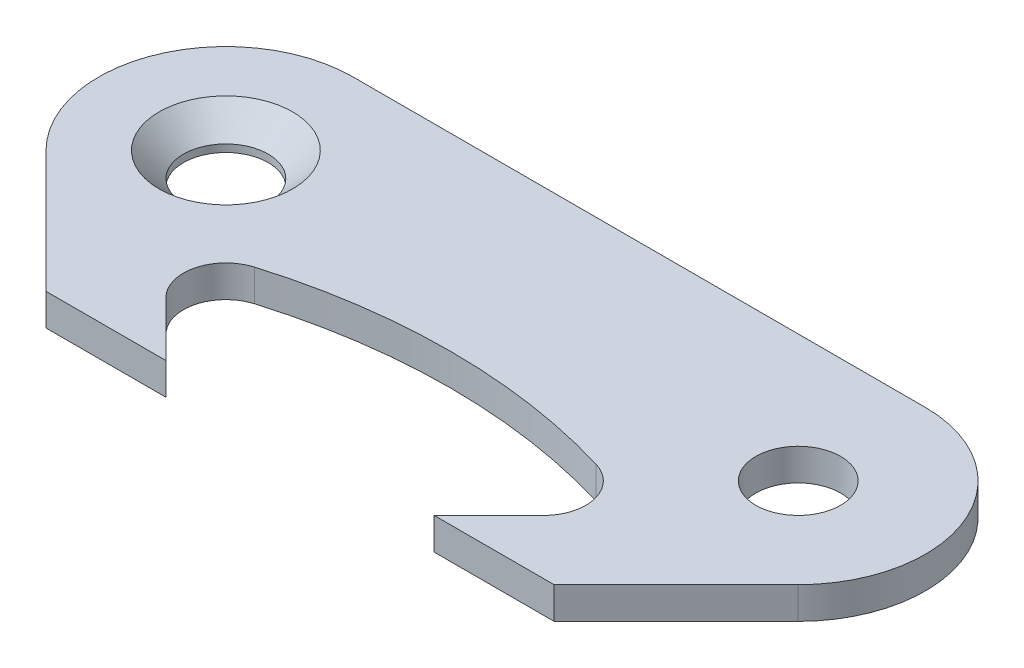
ISO-10303-21;
HEADER;
FILE_DESCRIPTION(('STEP AP214'),'2;1');
FILE_NAME('part.step','',(''),(''),'','','');
FILE_SCHEMA(('AUTOMOTIVE_DESIGN { 1 0 10303 214 1 1 1 1 }'));
ENDSEC;
DATA;
#1=APPLICATION_CONTEXT('core data for automotive mechanical design processes');
#2=APPLICATION_PROTOCOL_DEFINITION('international standard','automotive_design',2000,#1);
#3=PRODUCT_CONTEXT('',#1,'mechanical');
#4=PRODUCT('Part','Part','',(#3));
#5=PRODUCT_RELATED_PRODUCT_CATEGORY('part','',(#4));
#6=PRODUCT_DEFINITION_FORMATION('','',#4);
#7=PRODUCT_DEFINITION_CONTEXT('part definition',#1,'design');
#8=PRODUCT_DEFINITION('design','',#6,#7);
#9=PRODUCT_DEFINITION_SHAPE('','',#8);
#10=(LENGTH_UNIT() NAMED_UNIT(*) SI_UNIT(.MILLI.,.METRE.));
#11=(NAMED_UNIT(*) PLANE_ANGLE_UNIT() SI_UNIT($,.RADIAN.));
#12=(NAMED_UNIT(*) SI_UNIT($,.STERADIAN.) SOLID_ANGLE_UNIT());
#13=UNCERTAINTY_MEASURE_WITH_UNIT(LENGTH_MEASURE(1.E-05),#10,'distance_accuracy_value','');
#14=(GEOMETRIC_REPRESENTATION_CONTEXT(3) GLOBAL_UNCERTAINTY_ASSIGNED_CONTEXT((#13)) GLOBAL_UNIT_ASSIGNED_CONTEXT((#10,
#11,#12)) REPRESENTATION_CONTEXT('',''));
#15=CARTESIAN_POINT('',(0.,0.,0.));
#16=DIRECTION('',(0.,0.,1.));
#17=DIRECTION('',(1.,0.,0.));
#18=AXIS2_PLACEMENT_3D('',#15,#16,#17);
#19=CARTESIAN_POINT('',(0.,3.,0.));
#20=DIRECTION('',(0.,-1.,0.));
#21=DIRECTION('',(0.,0.,-1.));
#22=AXIS2_PLACEMENT_3D('',#19,#20,#21);
#23=CYLINDRICAL_SURFACE('',#22,4.);
#24=CARTESIAN_POINT('',(0.,0.,0.));
#25=DIRECTION('',(0.,1.,0.));
#26=DIRECTION('',(0.,0.,1.));
#27=AXIS2_PLACEMENT_3D('',#24,#25,#26);
#28=CIRCLE('',#27,4.);
#29=CARTESIAN_POINT('',(0.,0.,4.));
#30=VERTEX_POINT('',#29);
#31=EDGE_CURVE('E157',#30,#30,#28,.T.);
#32=ORIENTED_EDGE('',*,*,#31,.F.);
#33=EDGE_LOOP('',(#32));
#34=FACE_BOUND('',#33,.T.);
#35=CARTESIAN_POINT('',(0.,0.7,0.));
#36=DIRECTION('',(0.,1.,0.));
#37=DIRECTION('',(0.,0.,1.));
#38=AXIS2_PLACEMENT_3D('',#35,#36,#37);
#39=CIRCLE('',#38,4.);
#40=CARTESIAN_POINT('',(0.,0.7,4.));
#41=VERTEX_POINT('',#40);
#42=EDGE_CURVE('E284',#41,#41,#39,.T.);
#43=ORIENTED_EDGE('',*,*,#42,.T.);
#44=EDGE_LOOP('',(#43));
#45=FACE_BOUND('',#44,.T.);
#46=ADVANCED_FACE('F31',(#34,#45),#23,.F.);
#47=CARTESIAN_POINT('',(12.0208152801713,3.,12.0208152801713));
#48=DIRECTION('',(0.,1.,0.));
#49=DIRECTION('',(0.,0.,1.));
#50=AXIS2_PLACEMENT_3D('',#47,#48,#49);
#51=PLANE('',#50);
#52=CARTESIAN_POINT('',(0.,3.,0.));
#53=DIRECTION('',(0.,1.,0.));
#54=DIRECTION('',(0.,0.,1.));
#55=AXIS2_PLACEMENT_3D('',#52,#53,#54);
#56=CIRCLE('',#55,6.3);
#57=CARTESIAN_POINT('',(0.,3.,6.3));
#58=VERTEX_POINT('',#57);
#59=EDGE_CURVE('E288',#58,#58,#56,.T.);
#60=ORIENTED_EDGE('',*,*,#59,.F.);
#61=EDGE_LOOP('',(#60));
#62=FACE_BOUND('',#61,.T.);
#63=CARTESIAN_POINT('',(12.0208152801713,3.,12.0208152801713));
#64=DIRECTION('',(0.,-1.,0.));
#65=DIRECTION('',(0.,0.,1.));
#66=AXIS2_PLACEMENT_3D('',#63,#64,#65);
#67=CIRCLE('',#66,4.);
#68=CARTESIAN_POINT('',(9.19238815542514,3.,14.8492424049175));
#69=VERTEX_POINT('',#68);
#70=CARTESIAN_POINT('',(10.868570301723,3.,8.19036732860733));
#71=VERTEX_POINT('',#70);
#72=EDGE_CURVE('E176',#69,#71,#67,.T.);
#73=ORIENTED_EDGE('',*,*,#72,.T.);
#74=CARTESIAN_POINT('',(27.,3.,61.8166386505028));
#75=DIRECTION('',(0.,-1.,0.));
#76=DIRECTION('',(0.,0.,1.));
#77=AXIS2_PLACEMENT_3D('',#74,#75,#76);
#78=CIRCLE('',#77,56.);
#79=CARTESIAN_POINT('',(43.131429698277,3.,8.19036732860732));
#80=VERTEX_POINT('',#79);
#81=EDGE_CURVE('E103',#71,#80,#78,.T.);
#82=ORIENTED_EDGE('',*,*,#81,.T.);
#83=CARTESIAN_POINT('',(41.9791847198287,3.,12.0208152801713));
#84=DIRECTION('',(0.,-1.,0.));
#85=DIRECTION('',(0.,0.,1.));
#86=AXIS2_PLACEMENT_3D('',#83,#84,#85);
#87=CIRCLE('',#86,3.99999999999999);
#88=CARTESIAN_POINT('',(44.8076118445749,3.,14.8492424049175));
#89=VERTEX_POINT('',#88);
#90=EDGE_CURVE('E203',#80,#89,#87,.T.);
#91=ORIENTED_EDGE('',*,*,#90,.T.);
#92=DIRECTION('',(-0.707106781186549,0.,0.707106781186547));
#93=VECTOR('',#92,1.);
#94=CARTESIAN_POINT('',(44.8076118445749,3.,14.8492424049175));
#95=LINE('',#94,#93);
#96=CARTESIAN_POINT('',(39.6568542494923,3.,20.));
#97=VERTEX_POINT('',#96);
#98=EDGE_CURVE('E222',#89,#97,#95,.T.);
#99=ORIENTED_EDGE('',*,*,#98,.T.);
#100=DIRECTION('',(1.,0.,0.));
#101=VECTOR('',#100,1.);
#102=CARTESIAN_POINT('',(39.6568542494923,3.,20.));
#103=LINE('',#102,#101);
#104=CARTESIAN_POINT('',(50.9705627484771,3.,20.));
#105=VERTEX_POINT('',#104);
#106=EDGE_CURVE('E219',#97,#105,#103,.T.);
#107=ORIENTED_EDGE('',*,*,#106,.T.);
#108=DIRECTION('',(0.707106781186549,0.,-0.707106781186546));
#109=VECTOR('',#108,1.);
#110=CARTESIAN_POINT('',(62.4852813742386,3.,8.48528137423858));
#111=LINE('',#110,#109);
#112=CARTESIAN_POINT('',(62.4852813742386,3.,8.48528137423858));
#113=VERTEX_POINT('',#112);
#114=EDGE_CURVE('E221',#105,#113,#111,.T.);
#115=ORIENTED_EDGE('',*,*,#114,.T.);
#116=CARTESIAN_POINT('',(54.,3.,0.));
#117=DIRECTION('',(0.,1.,0.));
#118=DIRECTION('',(0.,0.,1.));
#119=AXIS2_PLACEMENT_3D('',#116,#117,#118);
#120=CIRCLE('',#119,12.);
#121=CARTESIAN_POINT('',(54.,3.,-12.));
#122=VERTEX_POINT('',#121);
#123=EDGE_CURVE('E224',#113,#122,#120,.T.);
#124=ORIENTED_EDGE('',*,*,#123,.T.);
#125=DIRECTION('',(-1.,0.,0.));
#126=VECTOR('',#125,1.);
#127=CARTESIAN_POINT('',(0.,3.,-12.));
#128=LINE('',#127,#126);
#129=CARTESIAN_POINT('',(0.,3.,-12.));
#130=VERTEX_POINT('',#129);
#131=EDGE_CURVE('E230',#122,#130,#128,.T.);
#132=ORIENTED_EDGE('',*,*,#131,.T.);
#133=CARTESIAN_POINT('',(0.,3.,0.));
#134=DIRECTION('',(0.,1.,0.));
#135=DIRECTION('',(0.,0.,1.));
#136=AXIS2_PLACEMENT_3D('',#133,#134,#135);
#137=CIRCLE('',#136,12.);
#138=CARTESIAN_POINT('',(-8.48528137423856,3.,8.48528137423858));
#139=VERTEX_POINT('',#138);
#140=EDGE_CURVE('E135',#130,#139,#137,.T.);
#141=ORIENTED_EDGE('',*,*,#140,.T.);
#142=DIRECTION('',(0.707106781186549,0.,0.707106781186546));
#143=VECTOR('',#142,1.);
#144=CARTESIAN_POINT('',(-8.48528137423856,3.,8.48528137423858));
#145=LINE('',#144,#143);
#146=CARTESIAN_POINT('',(3.0294372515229,3.,20.));
#147=VERTEX_POINT('',#146);
#148=EDGE_CURVE('E128',#139,#147,#145,.T.);
#149=ORIENTED_EDGE('',*,*,#148,.T.);
#150=DIRECTION('',(1.,0.,0.));
#151=VECTOR('',#150,1.);
#152=CARTESIAN_POINT('',(3.0294372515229,3.,20.));
#153=LINE('',#152,#151);
#154=CARTESIAN_POINT('',(14.3431457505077,3.,20.));
#155=VERTEX_POINT('',#154);
#156=EDGE_CURVE('E133',#147,#155,#153,.T.);
#157=ORIENTED_EDGE('',*,*,#156,.T.);
#158=DIRECTION('',(-0.707106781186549,0.,-0.707106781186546));
#159=VECTOR('',#158,1.);
#160=CARTESIAN_POINT('',(9.19238815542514,3.,14.8492424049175));
#161=LINE('',#160,#159);
#162=EDGE_CURVE('E48',#155,#69,#161,.T.);
#163=ORIENTED_EDGE('',*,*,#162,.T.);
#164=EDGE_LOOP('',(#73,#82,#91,#99,#107,#115,#124,#132,#141,#149,#157,#163));
#165=FACE_BOUND('',#164,.T.);
#166=CARTESIAN_POINT('',(54.,3.,0.));
#167=DIRECTION('',(0.,1.,0.));
#168=DIRECTION('',(0.,0.,1.));
#169=AXIS2_PLACEMENT_3D('',#166,#167,#168);
#170=CIRCLE('',#169,4.);
#171=CARTESIAN_POINT('',(54.,3.,4.));
#172=VERTEX_POINT('',#171);
#173=EDGE_CURVE('E275',#172,#172,#170,.T.);
#174=ORIENTED_EDGE('',*,*,#173,.F.);
#175=EDGE_LOOP('',(#174));
#176=FACE_BOUND('',#175,.T.);
#177=ADVANCED_FACE('F130',(#62,#165,#176),#51,.T.);
#178=CARTESIAN_POINT('',(12.0208152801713,0.,12.0208152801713));
#179=DIRECTION('',(0.,1.,0.));
#180=DIRECTION('',(0.,0.,1.));
#181=AXIS2_PLACEMENT_3D('',#178,#179,#180);
#182=PLANE('',#181);
#183=ORIENTED_EDGE('',*,*,#31,.T.);
#184=EDGE_LOOP('',(#183));
#185=FACE_BOUND('',#184,.T.);
#186=CARTESIAN_POINT('',(12.0208152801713,0.,12.0208152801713));
#187=DIRECTION('',(0.,-1.,0.));
#188=DIRECTION('',(0.,0.,1.));
#189=AXIS2_PLACEMENT_3D('',#186,#187,#188);
#190=CIRCLE('',#189,4.);
#191=CARTESIAN_POINT('',(9.19238815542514,0.,14.8492424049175));
#192=VERTEX_POINT('',#191);
#193=CARTESIAN_POINT('',(10.868570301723,0.,8.19036732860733));
#194=VERTEX_POINT('',#193);
#195=EDGE_CURVE('E153',#192,#194,#190,.T.);
#196=ORIENTED_EDGE('',*,*,#195,.F.);
#197=DIRECTION('',(-0.707106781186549,0.,-0.707106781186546));
#198=VECTOR('',#197,1.);
#199=CARTESIAN_POINT('',(9.19238815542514,0.,14.8492424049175));
#200=LINE('',#199,#198);
#201=CARTESIAN_POINT('',(14.3431457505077,0.,20.));
#202=VERTEX_POINT('',#201);
#203=EDGE_CURVE('E95',#202,#192,#200,.T.);
#204=ORIENTED_EDGE('',*,*,#203,.F.);
#205=DIRECTION('',(1.,0.,0.));
#206=VECTOR('',#205,1.);
#207=CARTESIAN_POINT('',(3.0294372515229,0.,20.));
#208=LINE('',#207,#206);
#209=CARTESIAN_POINT('',(3.0294372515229,0.,20.));
#210=VERTEX_POINT('',#209);
#211=EDGE_CURVE('E89',#210,#202,#208,.T.);
#212=ORIENTED_EDGE('',*,*,#211,.F.);
#213=DIRECTION('',(0.707106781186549,0.,0.707106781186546));
#214=VECTOR('',#213,1.);
#215=CARTESIAN_POINT('',(-8.48528137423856,0.,8.48528137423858));
#216=LINE('',#215,#214);
#217=CARTESIAN_POINT('',(-8.48528137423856,0.,8.48528137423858));
#218=VERTEX_POINT('',#217);
#219=EDGE_CURVE('E143',#218,#210,#216,.T.);
#220=ORIENTED_EDGE('',*,*,#219,.F.);
#221=CARTESIAN_POINT('',(0.,0.,0.));
#222=DIRECTION('',(0.,1.,0.));
#223=DIRECTION('',(0.,0.,1.));
#224=AXIS2_PLACEMENT_3D('',#221,#222,#223);
#225=CIRCLE('',#224,12.);
#226=CARTESIAN_POINT('',(0.,0.,-12.));
#227=VERTEX_POINT('',#226);
#228=EDGE_CURVE('E171',#227,#218,#225,.T.);
#229=ORIENTED_EDGE('',*,*,#228,.F.);
#230=DIRECTION('',(-1.,0.,0.));
#231=VECTOR('',#230,1.);
#232=CARTESIAN_POINT('',(0.,0.,-12.));
#233=LINE('',#232,#231);
#234=CARTESIAN_POINT('',(54.,0.,-12.));
#235=VERTEX_POINT('',#234);
#236=EDGE_CURVE('E169',#235,#227,#233,.T.);
#237=ORIENTED_EDGE('',*,*,#236,.F.);
#238=CARTESIAN_POINT('',(54.,0.,0.));
#239=DIRECTION('',(0.,1.,0.));
#240=DIRECTION('',(0.,0.,1.));
#241=AXIS2_PLACEMENT_3D('',#238,#239,#240);
#242=CIRCLE('',#241,12.);
#243=CARTESIAN_POINT('',(62.4852813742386,0.,8.48528137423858));
#244=VERTEX_POINT('',#243);
#245=EDGE_CURVE('E167',#244,#235,#242,.T.);
#246=ORIENTED_EDGE('',*,*,#245,.F.);
#247=DIRECTION('',(0.707106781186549,0.,-0.707106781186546));
#248=VECTOR('',#247,1.);
#249=CARTESIAN_POINT('',(62.4852813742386,0.,8.48528137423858));
#250=LINE('',#249,#248);
#251=CARTESIAN_POINT('',(50.9705627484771,0.,20.));
#252=VERTEX_POINT('',#251);
#253=EDGE_CURVE('E165',#252,#244,#250,.T.);
#254=ORIENTED_EDGE('',*,*,#253,.F.);
#255=DIRECTION('',(1.,0.,0.));
#256=VECTOR('',#255,1.);
#257=CARTESIAN_POINT('',(39.6568542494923,0.,20.));
#258=LINE('',#257,#256);
#259=CARTESIAN_POINT('',(39.6568542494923,0.,20.));
#260=VERTEX_POINT('',#259);
#261=EDGE_CURVE('E163',#260,#252,#258,.T.);
#262=ORIENTED_EDGE('',*,*,#261,.F.);
#263=DIRECTION('',(-0.707106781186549,0.,0.707106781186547));
#264=VECTOR('',#263,1.);
#265=CARTESIAN_POINT('',(44.8076118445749,0.,14.8492424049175));
#266=LINE('',#265,#264);
#267=CARTESIAN_POINT('',(44.8076118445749,0.,14.8492424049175));
#268=VERTEX_POINT('',#267);
#269=EDGE_CURVE('E161',#268,#260,#266,.T.);
#270=ORIENTED_EDGE('',*,*,#269,.F.);
#271=CARTESIAN_POINT('',(41.9791847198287,0.,12.0208152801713));
#272=DIRECTION('',(0.,-1.,0.));
#273=DIRECTION('',(0.,0.,1.));
#274=AXIS2_PLACEMENT_3D('',#271,#272,#273);
#275=CIRCLE('',#274,3.99999999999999);
#276=CARTESIAN_POINT('',(43.131429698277,0.,8.19036732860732));
#277=VERTEX_POINT('',#276);
#278=EDGE_CURVE('E159',#277,#268,#275,.T.);
#279=ORIENTED_EDGE('',*,*,#278,.F.);
#280=CARTESIAN_POINT('',(27.,0.,61.8166386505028));
#281=DIRECTION('',(0.,-1.,0.));
#282=DIRECTION('',(0.,0.,1.));
#283=AXIS2_PLACEMENT_3D('',#280,#281,#282);
#284=CIRCLE('',#283,56.);
#285=EDGE_CURVE('E156',#194,#277,#284,.T.);
#286=ORIENTED_EDGE('',*,*,#285,.F.);
#287=EDGE_LOOP('',(#196,#204,#212,#220,#229,#237,#246,#254,#262,#270,#279,#286));
#288=FACE_BOUND('',#287,.T.);
#289=CARTESIAN_POINT('',(54.,0.,0.));
#290=DIRECTION('',(0.,1.,0.));
#291=DIRECTION('',(0.,0.,1.));
#292=AXIS2_PLACEMENT_3D('',#289,#290,#291);
#293=CIRCLE('',#292,4.);
#294=CARTESIAN_POINT('',(54.,0.,4.));
#295=VERTEX_POINT('',#294);
#296=EDGE_CURVE('E278',#295,#295,#293,.T.);
#297=ORIENTED_EDGE('',*,*,#296,.T.);
#298=EDGE_LOOP('',(#297));
#299=FACE_BOUND('',#298,.T.);
#300=ADVANCED_FACE('F207',(#185,#288,#299),#182,.F.);
#301=CARTESIAN_POINT('',(12.0208152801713,3.,12.0208152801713));
#302=DIRECTION('',(0.,-1.,0.));
#303=DIRECTION('',(0.,0.,-1.));
#304=AXIS2_PLACEMENT_3D('',#301,#302,#303);
#305=CYLINDRICAL_SURFACE('',#304,4.);
#306=ORIENTED_EDGE('',*,*,#195,.T.);
#307=DIRECTION('',(0.,-1.,0.));
#308=VECTOR('',#307,1.);
#309=CARTESIAN_POINT('',(10.868570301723,3.,8.19036732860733));
#310=LINE('',#309,#308);
#311=EDGE_CURVE('E11',#71,#194,#310,.T.);
#312=ORIENTED_EDGE('',*,*,#311,.F.);
#313=ORIENTED_EDGE('',*,*,#72,.F.);
#314=DIRECTION('',(0.,-1.,0.));
#315=VECTOR('',#314,1.);
#316=CARTESIAN_POINT('',(9.19238815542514,3.,14.8492424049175));
#317=LINE('',#316,#315);
#318=EDGE_CURVE('E149',#69,#192,#317,.T.);
#319=ORIENTED_EDGE('',*,*,#318,.T.);
#320=EDGE_LOOP('',(#306,#312,#313,#319));
#321=FACE_BOUND('',#320,.T.);
#322=ADVANCED_FACE('F33',(#321),#305,.F.);
#323=CARTESIAN_POINT('',(27.,3.,61.8166386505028));
#324=DIRECTION('',(0.,-1.,0.));
#325=DIRECTION('',(0.,0.,-1.));
#326=AXIS2_PLACEMENT_3D('',#323,#324,#325);
#327=CYLINDRICAL_SURFACE('',#326,56.);
#328=ORIENTED_EDGE('',*,*,#285,.T.);
#329=DIRECTION('',(0.,-1.,0.));
#330=VECTOR('',#329,1.);
#331=CARTESIAN_POINT('',(43.131429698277,3.,8.19036732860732));
#332=LINE('',#331,#330);
#333=EDGE_CURVE('E40',#80,#277,#332,.T.);
#334=ORIENTED_EDGE('',*,*,#333,.F.);
#335=ORIENTED_EDGE('',*,*,#81,.F.);
#336=ORIENTED_EDGE('',*,*,#311,.T.);
#337=EDGE_LOOP('',(#328,#334,#335,#336));
#338=FACE_BOUND('',#337,.T.);
#339=ADVANCED_FACE('F273',(#338),#327,.F.);
#340=CARTESIAN_POINT('',(41.9791847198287,3.,12.0208152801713));
#341=DIRECTION('',(0.,-1.,0.));
#342=DIRECTION('',(0.,0.,-1.));
#343=AXIS2_PLACEMENT_3D('',#340,#341,#342);
#344=CYLINDRICAL_SURFACE('',#343,3.99999999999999);
#345=ORIENTED_EDGE('',*,*,#278,.T.);
#346=DIRECTION('',(0.,-1.,0.));
#347=VECTOR('',#346,1.);
#348=CARTESIAN_POINT('',(44.8076118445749,3.,14.8492424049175));
#349=LINE('',#348,#347);
#350=EDGE_CURVE('E195',#89,#268,#349,.T.);
#351=ORIENTED_EDGE('',*,*,#350,.F.);
#352=ORIENTED_EDGE('',*,*,#90,.F.);
#353=ORIENTED_EDGE('',*,*,#333,.T.);
#354=EDGE_LOOP('',(#345,#351,#352,#353));
#355=FACE_BOUND('',#354,.T.);
#356=ADVANCED_FACE('F201',(#355),#344,.F.);
#357=CARTESIAN_POINT('',(44.8076118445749,3.,14.8492424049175));
#358=DIRECTION('',(0.707106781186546,0.,0.707106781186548));
#359=DIRECTION('',(0.707106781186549,0.,-0.707106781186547));
#360=AXIS2_PLACEMENT_3D('',#357,#358,#359);
#361=PLANE('',#360);
#362=ORIENTED_EDGE('',*,*,#269,.T.);
#363=DIRECTION('',(0.,-1.,0.));
#364=VECTOR('',#363,1.);
#365=CARTESIAN_POINT('',(39.6568542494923,3.,20.));
#366=LINE('',#365,#364);
#367=EDGE_CURVE('E192',#97,#260,#366,.T.);
#368=ORIENTED_EDGE('',*,*,#367,.F.);
#369=ORIENTED_EDGE('',*,*,#98,.F.);
#370=ORIENTED_EDGE('',*,*,#350,.T.);
#371=EDGE_LOOP('',(#362,#368,#369,#370));
#372=FACE_BOUND('',#371,.T.);
#373=ADVANCED_FACE('F213',(#372),#361,.F.);
#374=CARTESIAN_POINT('',(39.6568542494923,3.,20.));
#375=DIRECTION('',(0.,0.,-1.));
#376=DIRECTION('',(-1.,0.,0.));
#377=AXIS2_PLACEMENT_3D('',#374,#375,#376);
#378=PLANE('',#377);
#379=ORIENTED_EDGE('',*,*,#261,.T.);
#380=DIRECTION('',(0.,-1.,0.));
#381=VECTOR('',#380,1.);
#382=CARTESIAN_POINT('',(50.9705627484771,3.,20.));
#383=LINE('',#382,#381);
#384=EDGE_CURVE('E189',#105,#252,#383,.T.);
#385=ORIENTED_EDGE('',*,*,#384,.F.);
#386=ORIENTED_EDGE('',*,*,#106,.F.);
#387=ORIENTED_EDGE('',*,*,#367,.T.);
#388=EDGE_LOOP('',(#379,#385,#386,#387));
#389=FACE_BOUND('',#388,.T.);
#390=ADVANCED_FACE('F217',(#389),#378,.F.);
#391=CARTESIAN_POINT('',(62.4852813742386,3.,8.48528137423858));
#392=DIRECTION('',(-0.707106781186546,0.,-0.707106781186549));
#393=DIRECTION('',(-0.707106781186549,0.,0.707106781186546));
#394=AXIS2_PLACEMENT_3D('',#391,#392,#393);
#395=PLANE('',#394);
#396=ORIENTED_EDGE('',*,*,#253,.T.);
#397=DIRECTION('',(0.,-1.,0.));
#398=VECTOR('',#397,1.);
#399=CARTESIAN_POINT('',(62.4852813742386,3.,8.48528137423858));
#400=LINE('',#399,#398);
#401=EDGE_CURVE('E186',#113,#244,#400,.T.);
#402=ORIENTED_EDGE('',*,*,#401,.F.);
#403=ORIENTED_EDGE('',*,*,#114,.F.);
#404=ORIENTED_EDGE('',*,*,#384,.T.);
#405=EDGE_LOOP('',(#396,#402,#403,#404));
#406=FACE_BOUND('',#405,.T.);
#407=ADVANCED_FACE('F353',(#406),#395,.F.);
#408=CARTESIAN_POINT('',(54.,3.,0.));
#409=DIRECTION('',(0.,-1.,0.));
#410=DIRECTION('',(0.,0.,-1.));
#411=AXIS2_PLACEMENT_3D('',#408,#409,#410);
#412=CYLINDRICAL_SURFACE('',#411,12.);
#413=ORIENTED_EDGE('',*,*,#245,.T.);
#414=DIRECTION('',(0.,-1.,0.));
#415=VECTOR('',#414,1.);
#416=CARTESIAN_POINT('',(54.,3.,-12.));
#417=LINE('',#416,#415);
#418=EDGE_CURVE('E183',#122,#235,#417,.T.);
#419=ORIENTED_EDGE('',*,*,#418,.F.);
#420=ORIENTED_EDGE('',*,*,#123,.F.);
#421=ORIENTED_EDGE('',*,*,#401,.T.);
#422=EDGE_LOOP('',(#413,#419,#420,#421));
#423=FACE_BOUND('',#422,.T.);
#424=ADVANCED_FACE('F361',(#423),#412,.T.);
#425=CARTESIAN_POINT('',(0.,3.,-12.));
#426=DIRECTION('',(0.,0.,1.));
#427=DIRECTION('',(1.,0.,0.));
#428=AXIS2_PLACEMENT_3D('',#425,#426,#427);
#429=PLANE('',#428);
#430=ORIENTED_EDGE('',*,*,#236,.T.);
#431=DIRECTION('',(0.,-1.,0.));
#432=VECTOR('',#431,1.);
#433=CARTESIAN_POINT('',(0.,3.,-12.));
#434=LINE('',#433,#432);
#435=EDGE_CURVE('E180',#130,#227,#434,.T.);
#436=ORIENTED_EDGE('',*,*,#435,.F.);
#437=ORIENTED_EDGE('',*,*,#131,.F.);
#438=ORIENTED_EDGE('',*,*,#418,.T.);
#439=EDGE_LOOP('',(#430,#436,#437,#438));
#440=FACE_BOUND('',#439,.T.);
#441=ADVANCED_FACE('F236',(#440),#429,.F.);
#442=CARTESIAN_POINT('',(0.,3.,0.));
#443=DIRECTION('',(0.,-1.,0.));
#444=DIRECTION('',(0.,0.,-1.));
#445=AXIS2_PLACEMENT_3D('',#442,#443,#444);
#446=CYLINDRICAL_SURFACE('',#445,12.);
#447=ORIENTED_EDGE('',*,*,#228,.T.);
#448=DIRECTION('',(0.,-1.,0.));
#449=VECTOR('',#448,1.);
#450=CARTESIAN_POINT('',(-8.48528137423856,3.,8.48528137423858));
#451=LINE('',#450,#449);
#452=EDGE_CURVE('E144',#139,#218,#451,.T.);
#453=ORIENTED_EDGE('',*,*,#452,.F.);
#454=ORIENTED_EDGE('',*,*,#140,.F.);
#455=ORIENTED_EDGE('',*,*,#435,.T.);
#456=EDGE_LOOP('',(#447,#453,#454,#455));
#457=FACE_BOUND('',#456,.T.);
#458=ADVANCED_FACE('F240',(#457),#446,.T.);
#459=CARTESIAN_POINT('',(-8.48528137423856,3.,8.48528137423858));
#460=DIRECTION('',(0.707106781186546,0.,-0.707106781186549));
#461=DIRECTION('',(-0.707106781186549,0.,-0.707106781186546));
#462=AXIS2_PLACEMENT_3D('',#459,#460,#461);
#463=PLANE('',#462);
#464=ORIENTED_EDGE('',*,*,#219,.T.);
#465=DIRECTION('',(0.,-1.,0.));
#466=VECTOR('',#465,1.);
#467=CARTESIAN_POINT('',(3.0294372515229,3.,20.));
#468=LINE('',#467,#466);
#469=EDGE_CURVE('E140',#147,#210,#468,.T.);
#470=ORIENTED_EDGE('',*,*,#469,.F.);
#471=ORIENTED_EDGE('',*,*,#148,.F.);
#472=ORIENTED_EDGE('',*,*,#452,.T.);
#473=EDGE_LOOP('',(#464,#470,#471,#472));
#474=FACE_BOUND('',#473,.T.);
#475=ADVANCED_FACE('F141',(#474),#463,.F.);
#476=CARTESIAN_POINT('',(3.0294372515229,3.,20.));
#477=DIRECTION('',(0.,0.,-1.));
#478=DIRECTION('',(-1.,0.,0.));
#479=AXIS2_PLACEMENT_3D('',#476,#477,#478);
#480=PLANE('',#479);
#481=ORIENTED_EDGE('',*,*,#211,.T.);
#482=DIRECTION('',(0.,-1.,0.));
#483=VECTOR('',#482,1.);
#484=CARTESIAN_POINT('',(14.3431457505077,3.,20.));
#485=LINE('',#484,#483);
#486=EDGE_CURVE('E145',#155,#202,#485,.T.);
#487=ORIENTED_EDGE('',*,*,#486,.F.);
#488=ORIENTED_EDGE('',*,*,#156,.F.);
#489=ORIENTED_EDGE('',*,*,#469,.T.);
#490=EDGE_LOOP('',(#481,#487,#488,#489));
#491=FACE_BOUND('',#490,.T.);
#492=ADVANCED_FACE('F147',(#491),#480,.F.);
#493=CARTESIAN_POINT('',(9.19238815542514,3.,14.8492424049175));
#494=DIRECTION('',(-0.707106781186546,0.,0.707106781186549));
#495=DIRECTION('',(0.707106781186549,0.,0.707106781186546));
#496=AXIS2_PLACEMENT_3D('',#493,#494,#495);
#497=PLANE('',#496);
#498=ORIENTED_EDGE('',*,*,#203,.T.);
#499=ORIENTED_EDGE('',*,*,#318,.F.);
#500=ORIENTED_EDGE('',*,*,#162,.F.);
#501=ORIENTED_EDGE('',*,*,#486,.T.);
#502=EDGE_LOOP('',(#498,#499,#500,#501));
#503=FACE_BOUND('',#502,.T.);
#504=ADVANCED_FACE('F244',(#503),#497,.F.);
#505=CARTESIAN_POINT('',(54.,3.,0.));
#506=DIRECTION('',(0.,-1.,0.));
#507=DIRECTION('',(0.,0.,-1.));
#508=AXIS2_PLACEMENT_3D('',#505,#506,#507);
#509=CYLINDRICAL_SURFACE('',#508,4.);
#510=ORIENTED_EDGE('',*,*,#173,.T.);
#511=EDGE_LOOP('',(#510));
#512=FACE_BOUND('',#511,.T.);
#513=ORIENTED_EDGE('',*,*,#296,.F.);
#514=EDGE_LOOP('',(#513));
#515=FACE_BOUND('',#514,.T.);
#516=ADVANCED_FACE('F246',(#512,#515),#509,.F.);
#517=CARTESIAN_POINT('',(0.,3.,0.));
#518=DIRECTION('',(0.,1.,0.));
#519=DIRECTION('',(0.,0.,1.));
#520=AXIS2_PLACEMENT_3D('',#517,#518,#519);
#521=CONICAL_SURFACE('',#520,6.3,0.785398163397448);
#522=ORIENTED_EDGE('',*,*,#42,.F.);
#523=EDGE_LOOP('',(#522));
#524=FACE_BOUND('',#523,.T.);
#525=ORIENTED_EDGE('',*,*,#59,.T.);
#526=EDGE_LOOP('',(#525));
#527=FACE_BOUND('',#526,.T.);
#528=ADVANCED_FACE('F252',(#524,#527),#521,.F.);
#529=CLOSED_SHELL('',(#46,#177,#300,#322,#339,#356,#373,#390,#407,#424,#441,#458,#475,#492,#504,
#516,#528));
#530=MANIFOLD_SOLID_BREP('B2',#529);
#531=ADVANCED_BREP_SHAPE_REPRESENTATION('',(#18,#530),#14);
#532=SHAPE_DEFINITION_REPRESENTATION(#9,#531);
ENDSEC;
END-ISO-10303-21;
